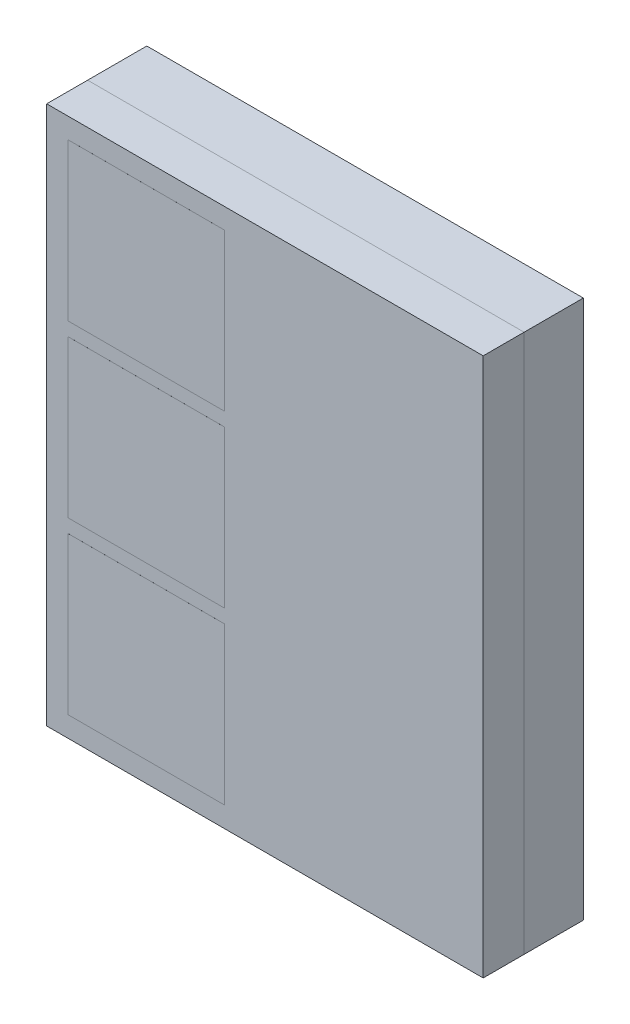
from build123d import *

# Parameters (mm, degrees)
SKETCH_1_W        = 1.15
SKETCH_1_H        = 1.15
EXTRUDE_1_DEPTH   = 0.0001
EXTRUDE_1_2_DEPTH = 0.0001
EXTRUDE_1_3_DEPTH = 0.0001
SKETCH_2_W        = 3.2
SKETCH_2_H        = 3.95
EXTRUDE_2_DEPTH   = 0.3
SKETCH_3_W        = 3.2
SKETCH_3_H        = 3.95
EXTRUDE_3_DEPTH   = 0.434
EXTRUDE_4_DEPTH   = 0.056
EXTRUDE_4_2_DEPTH = 0.056
EXTRUDE_4_3_DEPTH = 0.056
EXTRUDE_4_4_DEPTH = 0.056


with BuildPart() as part:
    # Sketch 1 → Extrude 1 (new body)
    with BuildSketch(Plane.XY):
        with Locations((0, 1.25)):
            Rectangle(SKETCH_1_W, SKETCH_1_H)
    extrude(amount=EXTRUDE_1_DEPTH)


with BuildPart() as body_2:
    # Sketch 1 → Extrude 1 2 (new body)
    with BuildSketch(Plane.XY):
        Rectangle(SKETCH_1_W, SKETCH_1_H)
    extrude(amount=EXTRUDE_1_2_DEPTH)


with BuildPart() as body_3:
    # Sketch 1 → Extrude 1 3 (new body)
    with BuildSketch(Plane.XY):
        with Locations((0, -1.25)):
            Rectangle(SKETCH_1_W, SKETCH_1_H)
    extrude(amount=EXTRUDE_1_3_DEPTH)


with BuildPart() as body_4:
    # Sketch 2 → Extrude 2 (new body)
    with BuildSketch(Plane(origin=(0, 0, 0), x_dir=(-1, 0, 0), z_dir=(0, 0, -1))):
        with Locations((-0.87, 0)):
            Rectangle(SKETCH_2_W, SKETCH_2_H)
    extrude(amount=EXTRUDE_2_DEPTH)


with BuildPart() as body_5:
    # Sketch 3 → Extrude 3 (new body)
    with BuildSketch(Plane(origin=(0, 0, -0.3), x_dir=(-1, 0, 0), z_dir=(0, 0, -1))):
        with Locations((-0.87, 0)):
            Rectangle(SKETCH_3_W, SKETCH_3_H)
    extrude(amount=EXTRUDE_3_DEPTH)


with BuildPart() as body_6:
    # Sketch 4 → Extrude 4 (new body)
    with BuildSketch(Plane(origin=(0, 0, -0.734), x_dir=(-1, 0, 0), z_dir=(0, 0, -1))):
        with BuildLine():
            Line((-1.32, 0.145), (-1.99, 0.145))
            ThreePointArc((-1.99, 0.145), (-2.202132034, 0.232867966), (-2.29, 0.445))
            Line((-2.29, 0.445), (-2.29, 1.345))
            ThreePointArc((-2.29, 1.345), (-2.202132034, 1.557132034), (-1.99, 1.645))
            Line((-1.99, 1.645), (-1.32, 1.645))
            ThreePointArc((-1.32, 1.645), (-1.107867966, 1.557132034), (-1.02, 1.345))
            Line((-1.02, 1.345), (-1.02, 0.445))
            ThreePointArc((-1.02, 0.445), (-1.107867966, 0.232867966), (-1.32, 0.145))
        make_face()
    extrude(amount=EXTRUDE_4_DEPTH)


with BuildPart() as body_7:
    # Sketch 4 → Extrude 4 2 (new body)
    with BuildSketch(Plane(origin=(0, 0, -0.734), x_dir=(-1, 0, 0), z_dir=(0, 0, -1))):
        with BuildLine():
            Line((-1.003921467, -1.345), (-1.003921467, -0.514909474))
            Line((-1.003921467, -0.514909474), (-1.403921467, -0.114909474))
            Line((-1.403921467, -0.114909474), (-1.99, -0.114909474))
            ThreePointArc((-1.99, -0.114909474), (-2.202132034, -0.202777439), (-2.29, -0.414909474))
            Line((-2.29, -0.414909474), (-2.29, -1.345))
            ThreePointArc((-2.29, -1.345), (-2.202132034, -1.557132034), (-1.99, -1.645))
            Line((-1.99, -1.645), (-1.303921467, -1.645))
            ThreePointArc((-1.303921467, -1.645), (-1.091789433, -1.557132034), (-1.003921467, -1.345))
        make_face()
    extrude(amount=EXTRUDE_4_2_DEPTH)


with BuildPart() as body_8:
    # Sketch 4 → Extrude 4 3 (new body)
    with BuildSketch(Plane(origin=(0, 0, -0.734), x_dir=(-1, 0, 0), z_dir=(0, 0, -1))):
        with BuildLine():
            Line((0.55, -1.345), (0.55, -0.445))
            ThreePointArc((0.55, -0.445), (0.462132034, -0.232867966), (0.25, -0.145))
            Line((0.25, -0.145), (-0.42, -0.145))
            ThreePointArc((-0.42, -0.145), (-0.632132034, -0.232867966), (-0.72, -0.445))
            Line((-0.72, -0.445), (-0.72, -1.345))
            ThreePointArc((-0.72, -1.345), (-0.632132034, -1.557132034), (-0.42, -1.645))
            Line((-0.42, -1.645), (0.25, -1.645))
            ThreePointArc((0.25, -1.645), (0.462132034, -1.557132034), (0.55, -1.345))
        make_face()
    extrude(amount=EXTRUDE_4_3_DEPTH)


with BuildPart() as body_9:
    # Sketch 4 → Extrude 4 4 (new body)
    with BuildSketch(Plane(origin=(0, 0, -0.734), x_dir=(-1, 0, 0), z_dir=(0, 0, -1))):
        with BuildLine():
            Line((0.55, 0.445), (0.55, 1.345))
            ThreePointArc((0.55, 1.345), (0.462132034, 1.557132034), (0.25, 1.645))
            Line((0.25, 1.645), (-0.423791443, 1.645))
            ThreePointArc((-0.423791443, 1.645), (-0.635923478, 1.557132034), (-0.723791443, 1.345))
            Line((-0.723791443, 1.345), (-0.723791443, 0.445))
            ThreePointArc((-0.723791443, 0.445), (-0.635923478, 0.232867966), (-0.423791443, 0.145))
            Line((-0.423791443, 0.145), (0.25, 0.145))
            ThreePointArc((0.25, 0.145), (0.462132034, 0.232867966), (0.55, 0.445))
        make_face()
    extrude(amount=EXTRUDE_4_4_DEPTH)


solid = Compound([part.part, body_2.part, body_3.part, body_4.part, body_5.part, body_6.part, body_7.part, body_8.part, body_9.part])
